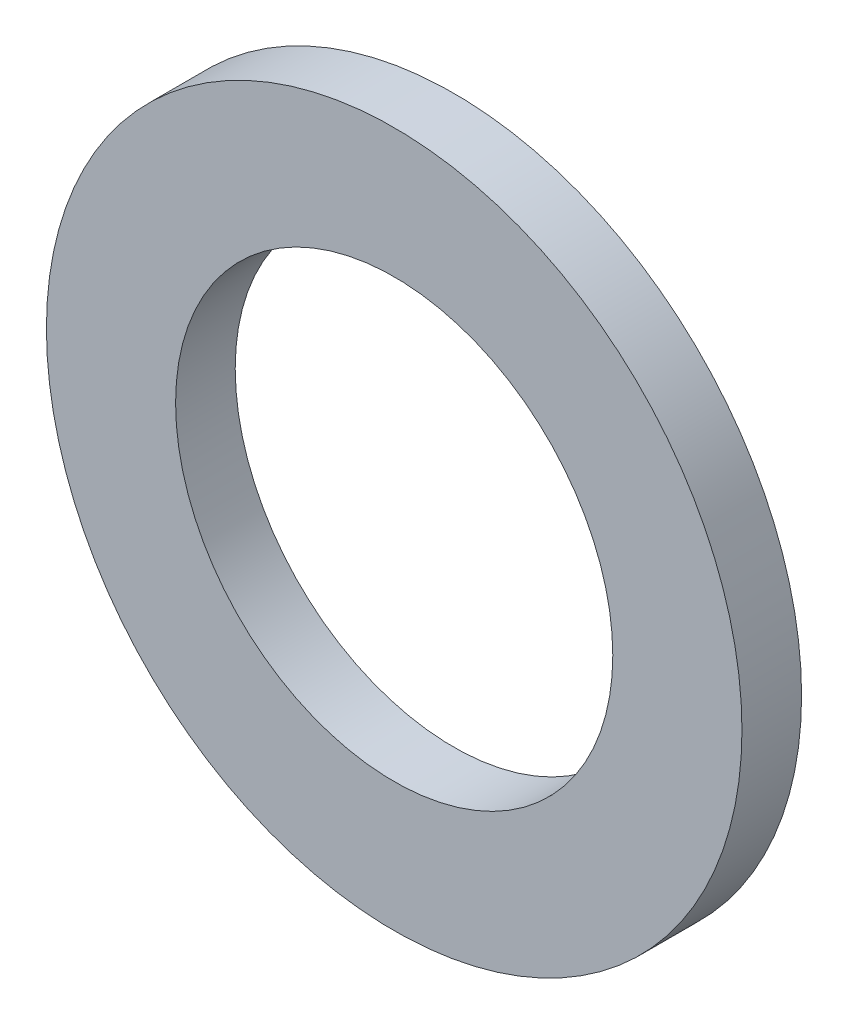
from build123d import *

# Parameters (mm, degrees)
ESQUISSE1_R      = 17.5
ESQUISSE1_R_2    = 11
EXTRUSION1_DEPTH = 3


with BuildPart() as part:
    # Esquisse1 → Extrusion1 (new body)
    with BuildSketch(Plane.XY):
        Circle(ESQUISSE1_R)
        Circle(ESQUISSE1_R_2, mode=Mode.SUBTRACT)
    extrude(amount=EXTRUSION1_DEPTH)


solid = part.part
